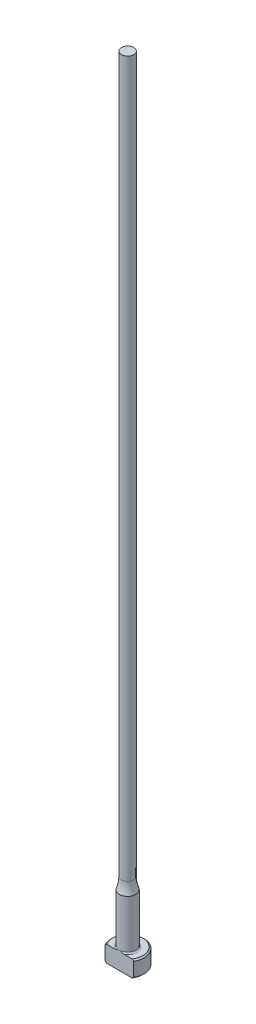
from build123d import *

# Parameters (mm, degrees)
CHAMFER1_SIZE = 0.254
FILLET1_R     = 0.254
KEY_DEPTH     = 153.466131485


with BuildPart() as part:
    # Sketch1 → Revolve1 (revolve)
    with BuildSketch(Plane.XY, mode=Mode.PRIVATE) as revolve1_sk:
        with BuildLine():
            Line((0, 0), (-3.175, 0))
            Line((-3.175, 0), (-3.175, 3.175))
            Line((-3.175, 3.175), (-1.5875, 3.175))
            Line((-1.5875, 3.175), (-1.5875, 12.7))
            ThreePointArc((-1.5875, 12.7), (-1.290157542, 13.787986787), (-1.18999, 14.911416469))
            Line((-1.18999, 14.911416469), (-1.18999, 152.4))
            Line((-1.18999, 152.4), (0, 152.4))
            Line((0, 152.4), (0, 0))
        make_face()
    revolve(revolve1_sk.sketch.rotate(Axis((0, 259.958771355, 0), (0, -1, 0)), 270), axis=Axis((0, 259.958771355, 0), (0, -1, 0)))

    # Chamfer1
    chamfer1_edges = [part.edges().sort_by_distance(p)[0] for p in [
        (0, 0, -3.175),
        (0, 3.175, -3.175),
    ]]
    chamfer(chamfer1_edges, length=CHAMFER1_SIZE)

    # Fillet1
    fillet1_edges = [part.edges().sort_by_distance(p)[0] for p in [
        (0, 3.175, -1.5875),
    ]]
    fillet(fillet1_edges, radius=FILLET1_R)

    # Sketch2 → KEY (cut, through all)
    with BuildSketch(Plane.XZ):
        with BuildLine():
            Line((-2.749630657, 1.5875), (2.749630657, 1.5875))
            ThreePointArc((2.749630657, 1.5875), (0, 3.175), (-2.749630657, 1.5875))
        make_face()
    extrude(amount=-KEY_DEPTH, mode=Mode.SUBTRACT)


solid = part.part
